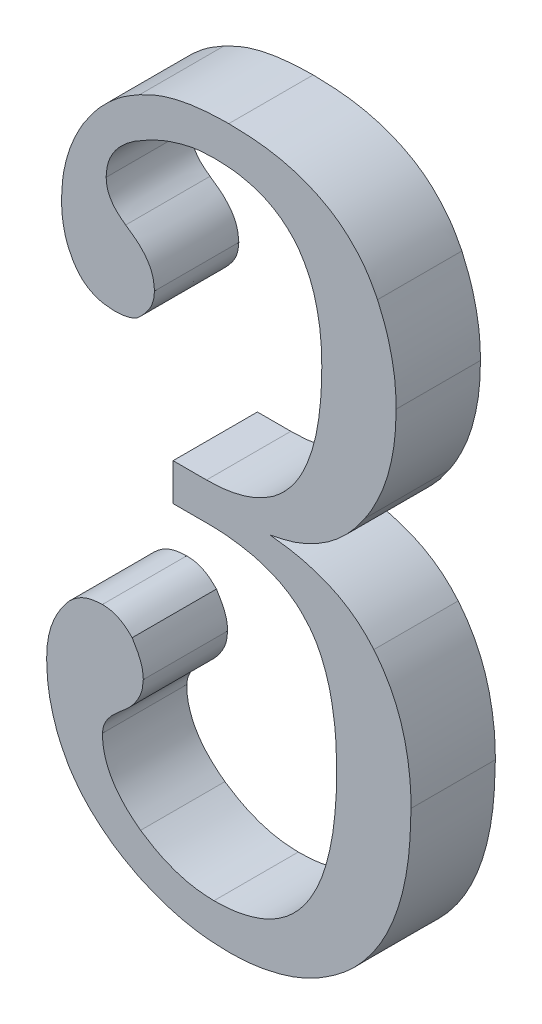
from build123d import *

# Parameters (mm, degrees)
EXTRUDE_1_DEPTH = 3


with BuildPart() as part:
    # Sketch 1 → Extrude 1 (new body)
    with BuildSketch(Plane.XY):
        with BuildLine():
            add(Edge.make_bspline(
                [(8.465608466, 23.941798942), (8.782839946, 23.933509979), (9.392295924, 23.917585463), (10.26801353, 23.791776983), (11.060639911, 23.573326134), (11.771003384, 23.266405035), (12.405062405, 22.880871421), (12.942215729, 22.389146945), (13.410433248, 21.822138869), (13.639877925, 21.385945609), (13.756613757, 21.164021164)],
                knots=[0, 0, 0, 0, 1.201260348, 2.307826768, 3.341845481, 4.305916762, 5.231044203, 6.137687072, 7.052500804, 8, 8, 8, 8], degree=3))
            add(Edge.make_bspline(
                [(13.756613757, 21.164021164), (13.858833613, 20.924413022), (14.062227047, 20.447649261), (14.263393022, 19.692897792), (14.398885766, 18.917009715), (14.411581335, 18.388472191), (14.417989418, 18.121693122)],
                knots=[0, 0, 0, 0, 0.995257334, 1.980327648, 2.980571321, 4, 4, 4, 4], degree=3))
            add(Edge.make_bspline(
                [(14.417989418, 18.121693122), (14.41334722, 17.935456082), (14.404169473, 17.567260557), (14.357890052, 17.024773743), (14.267240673, 16.501357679), (14.146201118, 15.998418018), (13.990421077, 15.51372053), (13.789301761, 15.053798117), (13.570249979, 14.604304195), (13.387358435, 14.326399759), (13.296100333, 14.187732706)],
                knots=[0, 0, 0, 0, 1.076399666, 2.128070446, 3.142636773, 4.142795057, 5.11560343, 6.079584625, 7.041762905, 8, 8, 8, 8], degree=3))
            add(Edge.make_bspline(
                [(13.296100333, 14.187732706), (13.19332796, 14.038137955), (12.990920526, 13.743515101), (12.634226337, 13.353708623), (12.256286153, 13.005798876), (11.845488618, 12.710502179), (11.40700653, 12.459774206), (10.940744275, 12.251317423), (10.441251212, 12.099621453), (10.096094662, 12.035393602), (9.920634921, 12.002743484)],
                knots=[0, 0, 0, 0, 1.049244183, 2.066458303, 3.049964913, 4.017908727, 4.987373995, 5.969062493, 6.967576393, 8, 8, 8, 8], degree=3))
            add(Edge.make_bspline(
                [(9.920634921, 12.002743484), (10.123514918, 11.979342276), (10.51828971, 11.933806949), (11.087459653, 11.822257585), (11.615426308, 11.670090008), (12.102216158, 11.480545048), (12.547070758, 11.248334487), (12.951019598, 10.979124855), (13.312453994, 10.668870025), (13.520703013, 10.434229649), (13.624338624, 10.317460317)],
                knots=[0, 0, 0, 0, 1.172166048, 2.280863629, 3.325265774, 4.322835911, 5.274733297, 6.20041547, 7.104432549, 8, 8, 8, 8], degree=3))
            add(Edge.make_bspline(
                [(13.624338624, 10.317460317), (13.730204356, 10.182383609), (13.943276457, 9.910519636), (14.210999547, 9.46023576), (14.443312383, 8.979251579), (14.628413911, 8.463260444), (14.77020113, 7.915201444), (14.871649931, 7.335283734), (14.937932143, 6.721438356), (14.943987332, 6.300394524), (14.947089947, 6.084656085)],
                knots=[0, 0, 0, 0, 0.909094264, 1.829700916, 2.770722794, 3.737520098, 4.730820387, 5.76852186, 6.856614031, 8, 8, 8, 8], degree=3))
            add(Edge.make_bspline(
                [(14.947089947, 6.084656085), (14.936622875, 5.68409043), (14.916462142, 4.912556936), (14.766436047, 3.802827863), (14.508511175, 2.790608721), (14.144807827, 1.873816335), (13.678103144, 1.051073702), (13.10267142, 0.3282983), (12.426425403, -0.302277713), (11.904193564, -0.628665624), (11.64021164, -0.793650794)],
                knots=[0, 0, 0, 0, 1.198157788, 2.307783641, 3.342245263, 4.315690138, 5.25010218, 6.16111707, 7.070466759, 8, 8, 8, 8], degree=3))
            add(Edge.make_bspline(
                [(11.64021164, -0.793650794), (11.400046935, -0.917190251), (10.918740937, -1.164771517), (10.134270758, -1.400527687), (9.314988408, -1.562822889), (8.752232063, -1.579041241), (8.465608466, -1.587301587)],
                knots=[0, 0, 0, 0, 0.978185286, 1.96034819, 2.961162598, 4, 4, 4, 4], degree=3))
            add(Edge.make_bspline(
                [(8.465608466, -1.587301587), (8.187404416, -1.579317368), (7.634090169, -1.56343772), (6.817149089, -1.420567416), (6.019524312, -1.191232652), (5.512543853, -0.969320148), (5.256711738, -0.85733882)],
                knots=[0, 0, 0, 0, 1.005613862, 2.000044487, 2.990783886, 4, 4, 4, 4], degree=3))
            add(Edge.make_bspline(
                [(5.256711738, -0.85733882), (4.994042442, -0.717681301), (4.482906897, -0.44591782), (3.813042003, 0.072756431), (3.225439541, 0.635129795), (2.926030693, 1.072094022), (2.777777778, 1.28845777)],
                knots=[0, 0, 0, 0, 1.073743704, 2.08942796, 3.053976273, 4, 4, 4, 4], degree=3))
            add(Edge.make_bspline(
                [(2.777777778, 1.28845777), (2.654545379, 1.512183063), (2.409469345, 1.957112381), (2.170593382, 2.685560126), (2.008957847, 3.445036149), (1.992493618, 3.96736976), (1.984126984, 4.232804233)],
                knots=[0, 0, 0, 0, 0.991311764, 1.971451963, 2.96915196, 4, 4, 4, 4], degree=3))
            add(Edge.make_bspline(
                [(1.984126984, 4.232804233), (1.988913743, 4.395011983), (1.998234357, 4.71085737), (2.096390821, 5.169248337), (2.249366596, 5.599050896), (2.402799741, 5.858122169), (2.47893396, 5.986674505)],
                knots=[0, 0, 0, 0, 1.051981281, 2.048382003, 3.031598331, 4, 4, 4, 4], degree=3))
            add(Edge.make_bspline(
                [(2.47893396, 5.986674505), (2.570491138, 6.122782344), (2.744698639, 6.381757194), (3.102509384, 6.674495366), (3.518823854, 6.850746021), (3.81631992, 6.868989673), (3.968253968, 6.878306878)],
                knots=[0, 0, 0, 0, 1.076146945, 2.047604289, 3.002893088, 4, 4, 4, 4], degree=3))
            add(Edge.make_bspline(
                [(3.968253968, 6.878306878), (4.065372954, 6.873076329), (4.25933439, 6.862630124), (4.539314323, 6.763967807), (4.799660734, 6.602911), (4.948975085, 6.458457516), (5.026455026, 6.383499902)],
                knots=[0, 0, 0, 0, 0.966840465, 1.930927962, 2.926348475, 4, 4, 4, 4], degree=3))
            add(Edge.make_bspline(
                [(5.026455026, 6.383499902), (5.085526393, 6.286581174), (5.197875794, 6.102248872), (5.32828174, 5.823292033), (5.407668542, 5.553370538), (5.418199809, 5.376387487), (5.423280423, 5.291005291)],
                knots=[0, 0, 0, 0, 1.155794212, 2.198235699, 3.130772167, 4, 4, 4, 4], degree=3))
            add(Edge.make_bspline(
                [(5.423280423, 5.291005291), (5.412562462, 5.165126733), (5.390535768, 4.906431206), (5.21236766, 4.536588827), (4.940200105, 4.178791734), (4.696675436, 3.978042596), (4.565941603, 3.870272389)],
                knots=[0, 0, 0, 0, 0.876592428, 1.801502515, 2.819758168, 4, 4, 4, 4], degree=3))
            add(Edge.make_bspline(
                [(4.565941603, 3.870272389), (4.47661831, 3.791281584), (4.31127875, 3.645067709), (4.11952279, 3.401849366), (3.995109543, 3.157682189), (3.976882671, 2.989616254), (3.968253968, 2.91005291)],
                knots=[0, 0, 0, 0, 1.226325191, 2.269957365, 3.180988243, 4, 4, 4, 4], degree=3))
            add(Edge.make_bspline(
                [(3.968253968, 2.91005291), (3.971756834, 2.801989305), (3.978771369, 2.585590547), (4.043819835, 2.266785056), (4.154406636, 1.960156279), (4.302042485, 1.662799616), (4.495856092, 1.37726074), (4.731680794, 1.103741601), (5.010365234, 0.840961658), (5.217676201, 0.68082196), (5.325298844, 0.597687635)],
                knots=[0, 0, 0, 0, 0.929203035, 1.860741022, 2.785256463, 3.727963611, 4.710170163, 5.746671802, 6.830215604, 8, 8, 8, 8], degree=3))
            add(Edge.make_bspline(
                [(5.325298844, 0.597687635), (5.532388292, 0.465294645), (5.936596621, 0.206882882), (6.592531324, -0.061975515), (7.259810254, -0.23329955), (7.711778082, -0.254171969), (7.936507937, -0.264550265)],
                knots=[0, 0, 0, 0, 1.054917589, 2.059044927, 3.034907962, 4, 4, 4, 4], degree=3))
            add(Edge.make_bspline(
                [(7.936507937, -0.264550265), (8.11312833, -0.260098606), (8.456554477, -0.251442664), (8.954672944, -0.177173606), (9.417217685, -0.053626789), (9.849870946, 0.110573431), (10.242137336, 0.33523272), (10.606680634, 0.600420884), (10.928314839, 0.922986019), (11.222946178, 1.288800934), (11.47340152, 1.709073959), (11.702580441, 2.170401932), (11.886449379, 2.684293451), (12.035963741, 3.245299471), (12.161051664, 3.853285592), (12.238131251, 4.510552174), (12.297065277, 5.214822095), (12.300044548, 5.700752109), (12.301587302, 5.952380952)],
                knots=[0, 0, 0, 0, 0.98122774, 1.907929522, 2.790703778, 3.638446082, 4.471486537, 5.295579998, 6.136297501, 6.995236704, 7.899581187, 8.849371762, 9.854279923, 10.926483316, 12.074517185, 13.300411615, 14.602073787, 16, 16, 16, 16], degree=3))
            add(Edge.make_bspline(
                [(12.301587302, 5.952380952), (12.298741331, 6.167987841), (12.29323703, 6.584986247), (12.251936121, 7.187580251), (12.169806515, 7.744414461), (12.073270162, 8.258932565), (11.933870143, 8.724811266), (11.772693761, 9.147749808), (11.580586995, 9.526878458), (11.419348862, 9.749350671), (11.341367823, 9.856946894)],
                knots=[0, 0, 0, 0, 1.265251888, 2.44708332, 3.54073694, 4.566853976, 5.515935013, 6.389702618, 7.221197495, 8, 8, 8, 8], degree=3))
            add(Edge.make_bspline(
                [(11.341367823, 9.856946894), (11.246410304, 9.967678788), (11.054674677, 10.191265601), (10.708557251, 10.474968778), (10.314303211, 10.711670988), (9.875572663, 10.908532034), (9.388306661, 11.059015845), (8.85612678, 11.163456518), (8.279800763, 11.236198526), (7.879598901, 11.240930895), (7.671957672, 11.243386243)],
                knots=[0, 0, 0, 0, 0.86078917, 1.738081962, 2.630165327, 3.571817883, 4.572960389, 5.63661787, 6.773779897, 8, 8, 8, 8], degree=3))
            Line((7.671957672, 11.243386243), (6.481481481, 11.243386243))
            Line((6.481481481, 11.243386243), (6.481481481, 12.566137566))
            Line((6.481481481, 12.566137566), (7.671957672, 12.566137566))
            add(Edge.make_bspline(
                [(7.671957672, 12.566137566), (7.837182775, 12.568770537), (8.159373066, 12.573904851), (8.625014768, 12.64635143), (9.060945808, 12.752268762), (9.465166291, 12.90335735), (9.834748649, 13.103037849), (10.178605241, 13.337179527), (10.482880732, 13.626730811), (10.757601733, 13.955329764), (11.000035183, 14.326605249), (11.204825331, 14.742298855), (11.380692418, 15.200052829), (11.527836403, 15.701085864), (11.639062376, 16.245283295), (11.715321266, 16.833131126), (11.766032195, 17.462691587), (11.770294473, 17.897863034), (11.772486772, 18.121693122)],
                knots=[0, 0, 0, 0, 1.006922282, 1.96350662, 2.867117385, 3.740402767, 4.587148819, 5.424466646, 6.27021594, 7.14008559, 8.032535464, 8.96808879, 9.961517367, 11.02064995, 12.14988882, 13.346000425, 14.634917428, 16, 16, 16, 16], degree=3))
            add(Edge.make_bspline(
                [(11.772486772, 18.121693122), (11.769674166, 18.303026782), (11.764217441, 18.654831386), (11.721958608, 19.166067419), (11.641354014, 19.641597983), (11.541450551, 20.08317557), (11.41001612, 20.489726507), (11.240796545, 20.859230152), (11.047304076, 21.197968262), (10.821031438, 21.50020887), (10.561089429, 21.761612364), (10.278403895, 21.995119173), (9.958810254, 22.184703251), (9.615023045, 22.350871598), (9.236253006, 22.468809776), (8.830305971, 22.560180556), (8.393138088, 22.605664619), (8.091723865, 22.614498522), (7.936507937, 22.619047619)],
                knots=[0, 0, 0, 0, 1.285766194, 2.494509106, 3.632873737, 4.702999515, 5.702645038, 6.656159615, 7.579672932, 8.464330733, 9.32408524, 10.188505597, 11.056331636, 11.952433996, 12.889852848, 13.861958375, 14.898996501, 16, 16, 16, 16], degree=3))
            add(Edge.make_bspline(
                [(7.936507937, 22.619047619), (7.731607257, 22.61251967), (7.321049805, 22.599439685), (6.711995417, 22.460091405), (6.103862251, 22.258959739), (5.718147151, 22.059489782), (5.521262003, 21.957671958)],
                knots=[0, 0, 0, 0, 0.970101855, 1.943783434, 2.95042091, 4, 4, 4, 4], degree=3))
            add(Edge.make_bspline(
                [(5.521262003, 21.957671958), (5.408905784, 21.897851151), (5.192920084, 21.782855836), (4.901857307, 21.580928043), (4.657378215, 21.366796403), (4.453758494, 21.141501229), (4.297628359, 20.901544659), (4.180138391, 20.648491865), (4.117125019, 20.379912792), (4.106083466, 20.197554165), (4.100529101, 20.105820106)],
                knots=[0, 0, 0, 0, 1.239438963, 2.382610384, 3.442347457, 4.400327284, 5.331505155, 6.22167838, 7.10542943, 8, 8, 8, 8], degree=3))
            add(Edge.make_bspline(
                [(4.100529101, 20.105820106), (4.108793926, 19.998180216), (4.125345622, 19.782613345), (4.26908842, 19.480274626), (4.493985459, 19.206341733), (4.691063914, 19.061303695), (4.796198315, 18.983931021)],
                knots=[0, 0, 0, 0, 0.935023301, 1.872540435, 2.865075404, 4, 4, 4, 4], degree=3))
            add(Edge.make_bspline(
                [(4.796198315, 18.983931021), (4.949621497, 18.878751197), (5.236960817, 18.681764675), (5.573596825, 18.313733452), (5.783715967, 17.899676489), (5.808018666, 17.606253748), (5.82010582, 17.46031746)],
                knots=[0, 0, 0, 0, 1.160335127, 2.17313904, 3.091395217, 4, 4, 4, 4], degree=3))
            add(Edge.make_bspline(
                [(5.82010582, 17.46031746), (5.814046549, 17.373127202), (5.801880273, 17.198059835), (5.713248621, 16.939628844), (5.56325518, 16.693583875), (5.429251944, 16.546936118), (5.359592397, 16.470703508)],
                knots=[0, 0, 0, 0, 0.933578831, 1.874512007, 2.89509733, 4, 4, 4, 4], degree=3))
            add(Edge.make_bspline(
                [(5.359592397, 16.470703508), (5.308482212, 16.417830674), (5.20046229, 16.30608544), (4.966591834, 16.209933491), (4.685778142, 16.143856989), (4.478329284, 16.139787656), (4.365079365, 16.137566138)],
                knots=[0, 0, 0, 0, 0.807711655, 1.707075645, 2.748252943, 4, 4, 4, 4], degree=3))
            add(Edge.make_bspline(
                [(4.365079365, 16.137566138), (4.213340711, 16.14759621), (3.92109618, 16.166913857), (3.511199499, 16.326974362), (3.159505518, 16.593633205), (2.994971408, 16.838916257), (2.91005291, 16.965510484)],
                knots=[0, 0, 0, 0, 1.034508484, 1.992435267, 2.963866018, 4, 4, 4, 4], degree=3))
            add(Edge.make_bspline(
                [(2.91005291, 16.965510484), (2.849304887, 17.081533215), (2.723280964, 17.322226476), (2.599878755, 17.726262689), (2.525511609, 18.174430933), (2.517447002, 18.48716687), (2.513227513, 18.650793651)],
                knots=[0, 0, 0, 0, 0.895869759, 1.85851352, 2.879551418, 4, 4, 4, 4], degree=3))
            add(Edge.make_bspline(
                [(2.513227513, 18.650793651), (2.522846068, 18.881829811), (2.542060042, 19.343346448), (2.692140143, 20.02498044), (2.925340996, 20.696419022), (3.155240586, 21.116284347), (3.272584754, 21.330589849)],
                knots=[0, 0, 0, 0, 0.983293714, 1.964222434, 2.960908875, 4, 4, 4, 4], degree=3))
            add(Edge.make_bspline(
                [(3.272584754, 21.330589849), (3.404505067, 21.53055669), (3.665828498, 21.926674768), (4.146436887, 22.445671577), (4.684225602, 22.897520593), (5.08786809, 23.129422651), (5.291005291, 23.246129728)],
                knots=[0, 0, 0, 0, 1.019467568, 2.019482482, 3.003284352, 4, 4, 4, 4], degree=3))
            add(Edge.make_bspline(
                [(5.291005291, 23.246129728), (5.507040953, 23.354225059), (5.956424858, 23.579078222), (6.715498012, 23.791612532), (7.561434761, 23.918386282), (8.154823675, 23.933751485), (8.465608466, 23.941798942)],
                knots=[0, 0, 0, 0, 0.881078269, 1.832764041, 2.864919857, 4, 4, 4, 4], degree=3))
        make_face()
    extrude(amount=EXTRUDE_1_DEPTH)


solid = part.part
